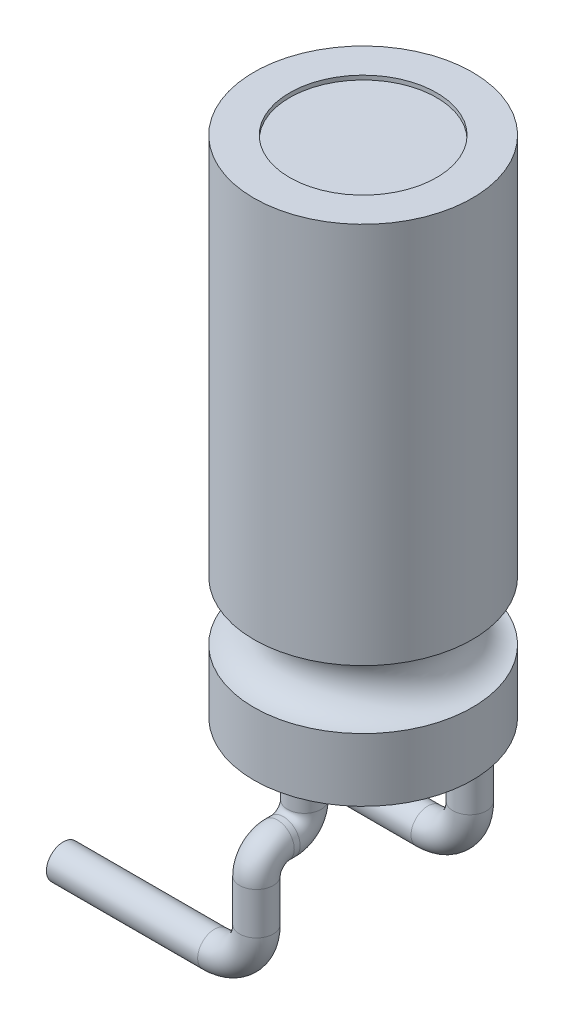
ISO-10303-21;
HEADER;
FILE_DESCRIPTION(('STEP AP214'),'2;1');
FILE_NAME('part.step','',(''),(''),'','','');
FILE_SCHEMA(('AUTOMOTIVE_DESIGN { 1 0 10303 214 1 1 1 1 }'));
ENDSEC;
DATA;
#1=APPLICATION_CONTEXT('core data for automotive mechanical design processes');
#2=APPLICATION_PROTOCOL_DEFINITION('international standard','automotive_design',2000,#1);
#3=PRODUCT_CONTEXT('',#1,'mechanical');
#4=PRODUCT('Part','Part','',(#3));
#5=PRODUCT_RELATED_PRODUCT_CATEGORY('part','',(#4));
#6=PRODUCT_DEFINITION_FORMATION('','',#4);
#7=PRODUCT_DEFINITION_CONTEXT('part definition',#1,'design');
#8=PRODUCT_DEFINITION('design','',#6,#7);
#9=PRODUCT_DEFINITION_SHAPE('','',#8);
#10=(LENGTH_UNIT() NAMED_UNIT(*) SI_UNIT(.MILLI.,.METRE.));
#11=(NAMED_UNIT(*) PLANE_ANGLE_UNIT() SI_UNIT($,.RADIAN.));
#12=(NAMED_UNIT(*) SI_UNIT($,.STERADIAN.) SOLID_ANGLE_UNIT());
#13=UNCERTAINTY_MEASURE_WITH_UNIT(LENGTH_MEASURE(1.E-05),#10,'distance_accuracy_value','');
#14=(GEOMETRIC_REPRESENTATION_CONTEXT(3) GLOBAL_UNCERTAINTY_ASSIGNED_CONTEXT((#13)) GLOBAL_UNIT_ASSIGNED_CONTEXT((#10,
#11,#12)) REPRESENTATION_CONTEXT('',''));
#15=CARTESIAN_POINT('',(0.,0.,0.));
#16=DIRECTION('',(0.,0.,1.));
#17=DIRECTION('',(1.,0.,0.));
#18=AXIS2_PLACEMENT_3D('',#15,#16,#17);
#19=CARTESIAN_POINT('',(2.6,27.5164236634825,0.));
#20=DIRECTION('',(0.,1.,0.));
#21=DIRECTION('',(0.,0.,1.));
#22=AXIS2_PLACEMENT_3D('',#19,#20,#21);
#23=PLANE('',#22);
#24=CARTESIAN_POINT('',(0.,27.5164236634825,-1.4));
#25=DIRECTION('',(0.,1.,0.));
#26=DIRECTION('',(0.,0.,1.));
#27=AXIS2_PLACEMENT_3D('',#24,#25,#26);
#28=CIRCLE('',#27,0.4);
#29=CARTESIAN_POINT('',(0.,27.5164236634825,-1.));
#30=VERTEX_POINT('',#29);
#31=EDGE_CURVE('E86',#30,#30,#28,.T.);
#32=ORIENTED_EDGE('',*,*,#31,.T.);
#33=EDGE_LOOP('',(#32));
#34=FACE_BOUND('',#33,.T.);
#35=CARTESIAN_POINT('',(0.,27.5164236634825,0.));
#36=DIRECTION('',(0.,1.,0.));
#37=DIRECTION('',(0.,0.,1.));
#38=AXIS2_PLACEMENT_3D('',#35,#36,#37);
#39=CIRCLE('',#38,2.6);
#40=CARTESIAN_POINT('',(0.,27.5164236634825,2.6));
#41=VERTEX_POINT('',#40);
#42=EDGE_CURVE('E33',#41,#41,#39,.T.);
#43=ORIENTED_EDGE('',*,*,#42,.F.);
#44=EDGE_LOOP('',(#43));
#45=FACE_BOUND('',#44,.T.);
#46=CARTESIAN_POINT('',(0.,27.5164236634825,1.4));
#47=DIRECTION('',(0.,-1.,0.));
#48=DIRECTION('',(0.,0.,-1.));
#49=AXIS2_PLACEMENT_3D('',#46,#47,#48);
#50=CIRCLE('',#49,0.4);
#51=CARTESIAN_POINT('',(0.,27.5164236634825,1.));
#52=VERTEX_POINT('',#51);
#53=EDGE_CURVE('E10',#52,#52,#50,.T.);
#54=ORIENTED_EDGE('',*,*,#53,.F.);
#55=EDGE_LOOP('',(#54));
#56=FACE_BOUND('',#55,.T.);
#57=ADVANCED_FACE('F30',(#34,#45,#56),#23,.F.);
#58=CARTESIAN_POINT('',(0.,48.4017094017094,0.));
#59=DIRECTION('',(0.,1.,0.));
#60=DIRECTION('',(0.,0.,1.));
#61=AXIS2_PLACEMENT_3D('',#58,#59,#60);
#62=CYLINDRICAL_SURFACE('',#61,2.6);
#63=CARTESIAN_POINT('',(0.,29.0164236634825,0.));
#64=DIRECTION('',(0.,1.,0.));
#65=DIRECTION('',(0.,0.,1.));
#66=AXIS2_PLACEMENT_3D('',#63,#64,#65);
#67=CIRCLE('',#66,2.6);
#68=CARTESIAN_POINT('',(0.,29.0164236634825,2.6));
#69=VERTEX_POINT('',#68);
#70=EDGE_CURVE('E41',#69,#69,#67,.T.);
#71=ORIENTED_EDGE('',*,*,#70,.F.);
#72=EDGE_LOOP('',(#71));
#73=FACE_BOUND('',#72,.T.);
#74=ORIENTED_EDGE('',*,*,#42,.T.);
#75=EDGE_LOOP('',(#74));
#76=FACE_BOUND('',#75,.T.);
#77=ADVANCED_FACE('F74',(#73,#76),#62,.T.);
#78=CARTESIAN_POINT('',(0.,29.7164236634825,0.));
#79=DIRECTION('',(0.,1.,0.));
#80=DIRECTION('',(0.,0.,1.));
#81=AXIS2_PLACEMENT_3D('',#78,#79,#80);
#82=TOROIDAL_SURFACE('',#81,2.6,0.699999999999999);
#83=CARTESIAN_POINT('',(0.,30.4164236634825,0.));
#84=DIRECTION('',(0.,1.,0.));
#85=DIRECTION('',(0.,0.,1.));
#86=AXIS2_PLACEMENT_3D('',#83,#84,#85);
#87=CIRCLE('',#86,2.6);
#88=CARTESIAN_POINT('',(0.,30.4164236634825,2.6));
#89=VERTEX_POINT('',#88);
#90=EDGE_CURVE('E67',#89,#89,#87,.T.);
#91=ORIENTED_EDGE('',*,*,#90,.F.);
#92=EDGE_LOOP('',(#91));
#93=FACE_BOUND('',#92,.T.);
#94=ORIENTED_EDGE('',*,*,#70,.T.);
#95=EDGE_LOOP('',(#94));
#96=FACE_BOUND('',#95,.T.);
#97=ADVANCED_FACE('F72',(#93,#96),#82,.F.);
#98=CARTESIAN_POINT('',(0.,48.4017094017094,0.));
#99=DIRECTION('',(0.,1.,0.));
#100=DIRECTION('',(0.,0.,1.));
#101=AXIS2_PLACEMENT_3D('',#98,#99,#100);
#102=CYLINDRICAL_SURFACE('',#101,2.6);
#103=CARTESIAN_POINT('',(0.,39.5164236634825,0.));
#104=DIRECTION('',(0.,1.,0.));
#105=DIRECTION('',(0.,0.,1.));
#106=AXIS2_PLACEMENT_3D('',#103,#104,#105);
#107=CIRCLE('',#106,2.6);
#108=CARTESIAN_POINT('',(0.,39.5164236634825,2.6));
#109=VERTEX_POINT('',#108);
#110=EDGE_CURVE('E64',#109,#109,#107,.T.);
#111=ORIENTED_EDGE('',*,*,#110,.F.);
#112=EDGE_LOOP('',(#111));
#113=FACE_BOUND('',#112,.T.);
#114=ORIENTED_EDGE('',*,*,#90,.T.);
#115=EDGE_LOOP('',(#114));
#116=FACE_BOUND('',#115,.T.);
#117=ADVANCED_FACE('F154',(#113,#116),#102,.T.);
#118=CARTESIAN_POINT('',(0.,39.5164236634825,0.));
#119=DIRECTION('',(0.,-1.,0.));
#120=DIRECTION('',(0.,0.,-1.));
#121=AXIS2_PLACEMENT_3D('',#118,#119,#120);
#122=PLANE('',#121);
#123=CARTESIAN_POINT('',(0.,39.5164236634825,0.));
#124=DIRECTION('',(0.,1.,0.));
#125=DIRECTION('',(0.,0.,1.));
#126=AXIS2_PLACEMENT_3D('',#123,#124,#125);
#127=CIRCLE('',#126,1.75);
#128=CARTESIAN_POINT('',(0.,39.5164236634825,1.75));
#129=VERTEX_POINT('',#128);
#130=EDGE_CURVE('E58',#129,#129,#127,.T.);
#131=ORIENTED_EDGE('',*,*,#130,.F.);
#132=EDGE_LOOP('',(#131));
#133=FACE_BOUND('',#132,.T.);
#134=ORIENTED_EDGE('',*,*,#110,.T.);
#135=EDGE_LOOP('',(#134));
#136=FACE_BOUND('',#135,.T.);
#137=ADVANCED_FACE('F150',(#133,#136),#122,.F.);
#138=CARTESIAN_POINT('',(0.,39.4164236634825,0.));
#139=DIRECTION('',(0.,1.,0.));
#140=DIRECTION('',(0.,0.,1.));
#141=AXIS2_PLACEMENT_3D('',#138,#139,#140);
#142=CYLINDRICAL_SURFACE('',#141,1.75);
#143=CARTESIAN_POINT('',(0.,39.4164236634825,0.));
#144=DIRECTION('',(0.,1.,0.));
#145=DIRECTION('',(0.,0.,1.));
#146=AXIS2_PLACEMENT_3D('',#143,#144,#145);
#147=CIRCLE('',#146,1.75);
#148=CARTESIAN_POINT('',(0.,39.4164236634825,1.75));
#149=VERTEX_POINT('',#148);
#150=EDGE_CURVE('E61',#149,#149,#147,.T.);
#151=ORIENTED_EDGE('',*,*,#150,.F.);
#152=EDGE_LOOP('',(#151));
#153=FACE_BOUND('',#152,.T.);
#154=ORIENTED_EDGE('',*,*,#130,.T.);
#155=EDGE_LOOP('',(#154));
#156=FACE_BOUND('',#155,.T.);
#157=ADVANCED_FACE('F146',(#153,#156),#142,.F.);
#158=CARTESIAN_POINT('',(0.,39.4164236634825,0.));
#159=DIRECTION('',(0.,1.,0.));
#160=DIRECTION('',(0.,0.,1.));
#161=AXIS2_PLACEMENT_3D('',#158,#159,#160);
#162=PLANE('',#161);
#163=ORIENTED_EDGE('',*,*,#150,.T.);
#164=EDGE_LOOP('',(#163));
#165=FACE_BOUND('',#164,.T.);
#166=ADVANCED_FACE('F142',(#165),#162,.T.);
#167=CARTESIAN_POINT('',(0.,25.5164236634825,2.04));
#168=DIRECTION('',(1.,0.,0.));
#169=DIRECTION('',(0.,0.,-1.));
#170=AXIS2_PLACEMENT_3D('',#167,#168,#169);
#171=TOROIDAL_SURFACE('',#170,0.500000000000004,0.4);
#172=CARTESIAN_POINT('',(0.,26.0164236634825,2.04));
#173=DIRECTION('',(0.,0.,1.));
#174=DIRECTION('',(0.,-1.,0.));
#175=AXIS2_PLACEMENT_3D('',#172,#173,#174);
#176=CIRCLE('',#175,0.4);
#177=CARTESIAN_POINT('',(0.,26.4164236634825,2.03999999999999));
#178=VERTEX_POINT('',#177);
#179=EDGE_CURVE('E52',#178,#178,#176,.T.);
#180=CARTESIAN_POINT('',(0.,25.5164236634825,2.54));
#181=DIRECTION('',(0.,-1.,0.));
#182=DIRECTION('',(0.,0.,-1.));
#183=AXIS2_PLACEMENT_3D('',#180,#181,#182);
#184=CIRCLE('',#183,0.4);
#185=CARTESIAN_POINT('',(0.,25.5164236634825,2.94));
#186=VERTEX_POINT('',#185);
#187=EDGE_CURVE('E55',#186,#186,#184,.T.);
#188=CARTESIAN_POINT('',(0.,25.5164236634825,2.04));
#189=DIRECTION('',(1.,0.,0.));
#190=DIRECTION('',(0.,0.,-1.));
#191=AXIS2_PLACEMENT_3D('',#188,#189,#190);
#192=CIRCLE('',#191,0.900000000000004);
#193=EDGE_CURVE('',#178,#186,#192,.T.);
#194=ORIENTED_EDGE('',*,*,#179,.T.);
#195=ORIENTED_EDGE('',*,*,#187,.F.);
#196=ORIENTED_EDGE('',*,*,#193,.T.);
#197=ORIENTED_EDGE('',*,*,#193,.F.);
#198=EDGE_LOOP('',(#194,#196,#195,#197));
#199=FACE_BOUND('',#198,.T.);
#200=ADVANCED_FACE('F138',(#199),#171,.T.);
#201=CARTESIAN_POINT('',(0.,26.0164236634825,1.9));
#202=DIRECTION('',(0.,0.,1.));
#203=DIRECTION('',(1.,0.,0.));
#204=AXIS2_PLACEMENT_3D('',#201,#202,#203);
#205=CYLINDRICAL_SURFACE('',#204,0.4);
#206=CARTESIAN_POINT('',(0.,26.0164236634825,1.9));
#207=DIRECTION('',(0.,0.,1.));
#208=DIRECTION('',(0.,-1.,0.));
#209=AXIS2_PLACEMENT_3D('',#206,#207,#208);
#210=CIRCLE('',#209,0.4);
#211=CARTESIAN_POINT('',(0.,25.6164236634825,1.9));
#212=VERTEX_POINT('',#211);
#213=EDGE_CURVE('E49',#212,#212,#210,.T.);
#214=ORIENTED_EDGE('',*,*,#213,.T.);
#215=EDGE_LOOP('',(#214));
#216=FACE_BOUND('',#215,.T.);
#217=ORIENTED_EDGE('',*,*,#179,.F.);
#218=EDGE_LOOP('',(#217));
#219=FACE_BOUND('',#218,.T.);
#220=ADVANCED_FACE('F134',(#216,#219),#205,.T.);
#221=CARTESIAN_POINT('',(0.,26.5164236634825,1.9));
#222=DIRECTION('',(-1.,0.,0.));
#223=DIRECTION('',(0.,0.,1.));
#224=AXIS2_PLACEMENT_3D('',#221,#222,#223);
#225=TOROIDAL_SURFACE('',#224,0.5,0.4);
#226=CARTESIAN_POINT('',(0.,26.5164236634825,1.4));
#227=DIRECTION('',(0.,-1.,0.));
#228=DIRECTION('',(0.,0.,-1.));
#229=AXIS2_PLACEMENT_3D('',#226,#227,#228);
#230=CIRCLE('',#229,0.4);
#231=CARTESIAN_POINT('',(0.,26.5164236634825,1.));
#232=VERTEX_POINT('',#231);
#233=EDGE_CURVE('E46',#232,#232,#230,.T.);
#234=CARTESIAN_POINT('',(0.,26.5164236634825,1.9));
#235=DIRECTION('',(-1.,0.,0.));
#236=DIRECTION('',(0.,0.,1.));
#237=AXIS2_PLACEMENT_3D('',#234,#235,#236);
#238=CIRCLE('',#237,0.9);
#239=EDGE_CURVE('',#232,#212,#238,.T.);
#240=ORIENTED_EDGE('',*,*,#233,.T.);
#241=ORIENTED_EDGE('',*,*,#213,.F.);
#242=ORIENTED_EDGE('',*,*,#239,.T.);
#243=ORIENTED_EDGE('',*,*,#239,.F.);
#244=EDGE_LOOP('',(#240,#242,#241,#243));
#245=FACE_BOUND('',#244,.T.);
#246=ADVANCED_FACE('F127',(#245),#225,.T.);
#247=CARTESIAN_POINT('',(0.,26.5164236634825,1.4));
#248=DIRECTION('',(0.,1.,0.));
#249=DIRECTION('',(0.,0.,1.));
#250=AXIS2_PLACEMENT_3D('',#247,#248,#249);
#251=CYLINDRICAL_SURFACE('',#250,0.4);
#252=ORIENTED_EDGE('',*,*,#233,.F.);
#253=EDGE_LOOP('',(#252));
#254=FACE_BOUND('',#253,.T.);
#255=ORIENTED_EDGE('',*,*,#53,.T.);
#256=EDGE_LOOP('',(#255));
#257=FACE_BOUND('',#256,.T.);
#258=ADVANCED_FACE('F118',(#254,#257),#251,.T.);
#259=CARTESIAN_POINT('',(-1.00000000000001,23.5164236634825,2.54));
#260=DIRECTION('',(-1.,0.,0.));
#261=DIRECTION('',(0.,0.,1.));
#262=AXIS2_PLACEMENT_3D('',#259,#260,#261);
#263=CYLINDRICAL_SURFACE('',#262,0.4);
#264=CARTESIAN_POINT('',(-1.00000000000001,23.5164236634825,2.54));
#265=DIRECTION('',(-1.,0.,0.));
#266=DIRECTION('',(0.,0.,-1.));
#267=AXIS2_PLACEMENT_3D('',#264,#265,#266);
#268=CIRCLE('',#267,0.4);
#269=CARTESIAN_POINT('',(-1.00000000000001,23.1164236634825,2.54));
#270=VERTEX_POINT('',#269);
#271=EDGE_CURVE('E106',#270,#270,#268,.T.);
#272=ORIENTED_EDGE('',*,*,#271,.T.);
#273=EDGE_LOOP('',(#272));
#274=FACE_BOUND('',#273,.T.);
#275=CARTESIAN_POINT('',(-4.6,23.5164236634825,2.54));
#276=DIRECTION('',(-1.,0.,0.));
#277=DIRECTION('',(0.,0.,-1.));
#278=AXIS2_PLACEMENT_3D('',#275,#276,#277);
#279=CIRCLE('',#278,0.4);
#280=CARTESIAN_POINT('',(-4.6,23.5164236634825,2.14));
#281=VERTEX_POINT('',#280);
#282=EDGE_CURVE('E44',#281,#281,#279,.T.);
#283=ORIENTED_EDGE('',*,*,#282,.F.);
#284=EDGE_LOOP('',(#283));
#285=FACE_BOUND('',#284,.T.);
#286=ADVANCED_FACE('F115',(#274,#285),#263,.T.);
#287=CARTESIAN_POINT('',(-1.,24.5164236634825,2.54));
#288=DIRECTION('',(0.,0.,-1.));
#289=DIRECTION('',(-1.,0.,0.));
#290=AXIS2_PLACEMENT_3D('',#287,#288,#289);
#291=TOROIDAL_SURFACE('',#290,1.,0.4);
#292=CARTESIAN_POINT('',(0.,24.5164236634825,2.54));
#293=DIRECTION('',(0.,-1.,0.));
#294=DIRECTION('',(0.,0.,-1.));
#295=AXIS2_PLACEMENT_3D('',#292,#293,#294);
#296=CIRCLE('',#295,0.4);
#297=CARTESIAN_POINT('',(0.4,24.5164236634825,2.54));
#298=VERTEX_POINT('',#297);
#299=EDGE_CURVE('E104',#298,#298,#296,.T.);
#300=CARTESIAN_POINT('',(-1.,24.5164236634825,2.54));
#301=DIRECTION('',(0.,0.,-1.));
#302=DIRECTION('',(-1.,0.,0.));
#303=AXIS2_PLACEMENT_3D('',#300,#301,#302);
#304=CIRCLE('',#303,1.4);
#305=EDGE_CURVE('',#298,#270,#304,.T.);
#306=ORIENTED_EDGE('',*,*,#299,.T.);
#307=ORIENTED_EDGE('',*,*,#271,.F.);
#308=ORIENTED_EDGE('',*,*,#305,.T.);
#309=ORIENTED_EDGE('',*,*,#305,.F.);
#310=EDGE_LOOP('',(#306,#308,#307,#309));
#311=FACE_BOUND('',#310,.T.);
#312=ADVANCED_FACE('F117',(#311),#291,.T.);
#313=CARTESIAN_POINT('',(0.,24.5164236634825,2.54));
#314=DIRECTION('',(0.,1.,0.));
#315=DIRECTION('',(-1.,0.,0.));
#316=AXIS2_PLACEMENT_3D('',#313,#314,#315);
#317=CYLINDRICAL_SURFACE('',#316,0.4);
#318=ORIENTED_EDGE('',*,*,#299,.F.);
#319=EDGE_LOOP('',(#318));
#320=FACE_BOUND('',#319,.T.);
#321=ORIENTED_EDGE('',*,*,#187,.T.);
#322=EDGE_LOOP('',(#321));
#323=FACE_BOUND('',#322,.T.);
#324=ADVANCED_FACE('F124',(#320,#323),#317,.T.);
#325=CARTESIAN_POINT('',(-4.6,23.5164236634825,2.54));
#326=DIRECTION('',(-1.,0.,0.));
#327=DIRECTION('',(0.,0.,-1.));
#328=AXIS2_PLACEMENT_3D('',#325,#326,#327);
#329=PLANE('',#328);
#330=ORIENTED_EDGE('',*,*,#282,.T.);
#331=EDGE_LOOP('',(#330));
#332=FACE_BOUND('',#331,.T.);
#333=ADVANCED_FACE('F113',(#332),#329,.T.);
#334=CARTESIAN_POINT('',(0.,25.5164236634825,-2.04));
#335=DIRECTION('',(-1.,0.,0.));
#336=DIRECTION('',(0.,0.,1.));
#337=AXIS2_PLACEMENT_3D('',#334,#335,#336);
#338=TOROIDAL_SURFACE('',#337,0.500000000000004,0.4);
#339=CARTESIAN_POINT('',(0.,26.0164236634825,-2.04));
#340=DIRECTION('',(0.,0.,1.));
#341=DIRECTION('',(0.,-1.,0.));
#342=AXIS2_PLACEMENT_3D('',#339,#340,#341);
#343=CIRCLE('',#342,0.4);
#344=CARTESIAN_POINT('',(0.,26.4164236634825,-2.03999999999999));
#345=VERTEX_POINT('',#344);
#346=EDGE_CURVE('E101',#345,#345,#343,.T.);
#347=CARTESIAN_POINT('',(0.,25.5164236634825,-2.54));
#348=DIRECTION('',(0.,1.,0.));
#349=DIRECTION('',(0.,0.,1.));
#350=AXIS2_PLACEMENT_3D('',#347,#348,#349);
#351=CIRCLE('',#350,0.4);
#352=CARTESIAN_POINT('',(0.,25.5164236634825,-2.94));
#353=VERTEX_POINT('',#352);
#354=EDGE_CURVE('E322',#353,#353,#351,.T.);
#355=CARTESIAN_POINT('',(0.,25.5164236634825,-2.04));
#356=DIRECTION('',(-1.,0.,0.));
#357=DIRECTION('',(0.,0.,1.));
#358=AXIS2_PLACEMENT_3D('',#355,#356,#357);
#359=CIRCLE('',#358,0.900000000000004);
#360=EDGE_CURVE('',#345,#353,#359,.T.);
#361=ORIENTED_EDGE('',*,*,#346,.F.);
#362=ORIENTED_EDGE('',*,*,#354,.T.);
#363=ORIENTED_EDGE('',*,*,#360,.T.);
#364=ORIENTED_EDGE('',*,*,#360,.F.);
#365=EDGE_LOOP('',(#361,#363,#362,#364));
#366=FACE_BOUND('',#365,.T.);
#367=ADVANCED_FACE('F225',(#366),#338,.T.);
#368=CARTESIAN_POINT('',(0.,26.0164236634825,-1.9));
#369=DIRECTION('',(0.,0.,-1.));
#370=DIRECTION('',(-1.,0.,0.));
#371=AXIS2_PLACEMENT_3D('',#368,#369,#370);
#372=CYLINDRICAL_SURFACE('',#371,0.4);
#373=CARTESIAN_POINT('',(0.,26.0164236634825,-1.9));
#374=DIRECTION('',(0.,0.,1.));
#375=DIRECTION('',(0.,-1.,0.));
#376=AXIS2_PLACEMENT_3D('',#373,#374,#375);
#377=CIRCLE('',#376,0.4);
#378=CARTESIAN_POINT('',(0.,25.6164236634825,-1.9));
#379=VERTEX_POINT('',#378);
#380=EDGE_CURVE('E92',#379,#379,#377,.T.);
#381=ORIENTED_EDGE('',*,*,#380,.F.);
#382=EDGE_LOOP('',(#381));
#383=FACE_BOUND('',#382,.T.);
#384=ORIENTED_EDGE('',*,*,#346,.T.);
#385=EDGE_LOOP('',(#384));
#386=FACE_BOUND('',#385,.T.);
#387=ADVANCED_FACE('F240',(#383,#386),#372,.T.);
#388=CARTESIAN_POINT('',(0.,26.5164236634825,-1.9));
#389=DIRECTION('',(1.,0.,0.));
#390=DIRECTION('',(0.,0.,-1.));
#391=AXIS2_PLACEMENT_3D('',#388,#389,#390);
#392=TOROIDAL_SURFACE('',#391,0.5,0.4);
#393=CARTESIAN_POINT('',(0.,26.5164236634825,-1.4));
#394=DIRECTION('',(0.,1.,0.));
#395=DIRECTION('',(0.,0.,1.));
#396=AXIS2_PLACEMENT_3D('',#393,#394,#395);
#397=CIRCLE('',#396,0.4);
#398=CARTESIAN_POINT('',(0.,26.5164236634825,-1.));
#399=VERTEX_POINT('',#398);
#400=EDGE_CURVE('E88',#399,#399,#397,.T.);
#401=CARTESIAN_POINT('',(0.,26.5164236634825,-1.9));
#402=DIRECTION('',(1.,0.,0.));
#403=DIRECTION('',(0.,0.,-1.));
#404=AXIS2_PLACEMENT_3D('',#401,#402,#403);
#405=CIRCLE('',#404,0.9);
#406=EDGE_CURVE('',#399,#379,#405,.T.);
#407=ORIENTED_EDGE('',*,*,#400,.F.);
#408=ORIENTED_EDGE('',*,*,#380,.T.);
#409=ORIENTED_EDGE('',*,*,#406,.T.);
#410=ORIENTED_EDGE('',*,*,#406,.F.);
#411=EDGE_LOOP('',(#407,#409,#408,#410));
#412=FACE_BOUND('',#411,.T.);
#413=ADVANCED_FACE('F250',(#412),#392,.T.);
#414=CARTESIAN_POINT('',(0.,26.5164236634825,-1.4));
#415=DIRECTION('',(0.,1.,0.));
#416=DIRECTION('',(0.,0.,1.));
#417=AXIS2_PLACEMENT_3D('',#414,#415,#416);
#418=CYLINDRICAL_SURFACE('',#417,0.4);
#419=ORIENTED_EDGE('',*,*,#400,.T.);
#420=EDGE_LOOP('',(#419));
#421=FACE_BOUND('',#420,.T.);
#422=ORIENTED_EDGE('',*,*,#31,.F.);
#423=EDGE_LOOP('',(#422));
#424=FACE_BOUND('',#423,.T.);
#425=ADVANCED_FACE('F260',(#421,#424),#418,.T.);
#426=CARTESIAN_POINT('',(-1.00000000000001,23.5164236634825,-2.54));
#427=DIRECTION('',(-1.,0.,0.));
#428=DIRECTION('',(0.,0.,1.));
#429=AXIS2_PLACEMENT_3D('',#426,#427,#428);
#430=CYLINDRICAL_SURFACE('',#429,0.4);
#431=CARTESIAN_POINT('',(-1.00000000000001,23.5164236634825,-2.54));
#432=DIRECTION('',(1.,0.,0.));
#433=DIRECTION('',(0.,0.,1.));
#434=AXIS2_PLACEMENT_3D('',#431,#432,#433);
#435=CIRCLE('',#434,0.4);
#436=CARTESIAN_POINT('',(-1.00000000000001,23.1164236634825,-2.54));
#437=VERTEX_POINT('',#436);
#438=EDGE_CURVE('E95',#437,#437,#435,.T.);
#439=ORIENTED_EDGE('',*,*,#438,.F.);
#440=EDGE_LOOP('',(#439));
#441=FACE_BOUND('',#440,.T.);
#442=CARTESIAN_POINT('',(-4.6,23.5164236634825,-2.54));
#443=DIRECTION('',(1.,0.,0.));
#444=DIRECTION('',(0.,0.,1.));
#445=AXIS2_PLACEMENT_3D('',#442,#443,#444);
#446=CIRCLE('',#445,0.4);
#447=CARTESIAN_POINT('',(-4.6,23.5164236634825,-2.14));
#448=VERTEX_POINT('',#447);
#449=EDGE_CURVE('E89',#448,#448,#446,.T.);
#450=ORIENTED_EDGE('',*,*,#449,.T.);
#451=EDGE_LOOP('',(#450));
#452=FACE_BOUND('',#451,.T.);
#453=ADVANCED_FACE('F270',(#441,#452),#430,.T.);
#454=CARTESIAN_POINT('',(-1.,24.5164236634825,-2.54));
#455=DIRECTION('',(0.,0.,-1.));
#456=DIRECTION('',(-1.,0.,0.));
#457=AXIS2_PLACEMENT_3D('',#454,#455,#456);
#458=TOROIDAL_SURFACE('',#457,1.,0.4);
#459=CARTESIAN_POINT('',(0.,24.5164236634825,-2.54));
#460=DIRECTION('',(0.,1.,0.));
#461=DIRECTION('',(0.,0.,1.));
#462=AXIS2_PLACEMENT_3D('',#459,#460,#461);
#463=CIRCLE('',#462,0.4);
#464=CARTESIAN_POINT('',(0.4,24.5164236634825,-2.54));
#465=VERTEX_POINT('',#464);
#466=EDGE_CURVE('E319',#465,#465,#463,.T.);
#467=CARTESIAN_POINT('',(-1.,24.5164236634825,-2.54));
#468=DIRECTION('',(0.,0.,-1.));
#469=DIRECTION('',(-1.,0.,0.));
#470=AXIS2_PLACEMENT_3D('',#467,#468,#469);
#471=CIRCLE('',#470,1.4);
#472=EDGE_CURVE('',#465,#437,#471,.T.);
#473=ORIENTED_EDGE('',*,*,#466,.F.);
#474=ORIENTED_EDGE('',*,*,#438,.T.);
#475=ORIENTED_EDGE('',*,*,#472,.T.);
#476=ORIENTED_EDGE('',*,*,#472,.F.);
#477=EDGE_LOOP('',(#473,#475,#474,#476));
#478=FACE_BOUND('',#477,.T.);
#479=ADVANCED_FACE('F280',(#478),#458,.T.);
#480=CARTESIAN_POINT('',(0.,24.5164236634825,-2.54));
#481=DIRECTION('',(0.,1.,0.));
#482=DIRECTION('',(-1.,0.,0.));
#483=AXIS2_PLACEMENT_3D('',#480,#481,#482);
#484=CYLINDRICAL_SURFACE('',#483,0.4);
#485=ORIENTED_EDGE('',*,*,#466,.T.);
#486=EDGE_LOOP('',(#485));
#487=FACE_BOUND('',#486,.T.);
#488=ORIENTED_EDGE('',*,*,#354,.F.);
#489=EDGE_LOOP('',(#488));
#490=FACE_BOUND('',#489,.T.);
#491=ADVANCED_FACE('F290',(#487,#490),#484,.T.);
#492=CARTESIAN_POINT('',(-4.6,23.5164236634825,-2.54));
#493=DIRECTION('',(-1.,0.,0.));
#494=DIRECTION('',(0.,0.,1.));
#495=AXIS2_PLACEMENT_3D('',#492,#493,#494);
#496=PLANE('',#495);
#497=ORIENTED_EDGE('',*,*,#449,.F.);
#498=EDGE_LOOP('',(#497));
#499=FACE_BOUND('',#498,.T.);
#500=ADVANCED_FACE('F300',(#499),#496,.T.);
#501=CLOSED_SHELL('',(#57,#77,#97,#117,#137,#157,#166,#200,#220,#246,#258,#286,#312,#324,#333,
#367,#387,#413,#425,#453,#479,#491,#500));
#502=MANIFOLD_SOLID_BREP('B2',#501);
#503=ADVANCED_BREP_SHAPE_REPRESENTATION('',(#18,#502),#14);
#504=SHAPE_DEFINITION_REPRESENTATION(#9,#503);
ENDSEC;
END-ISO-10303-21;
